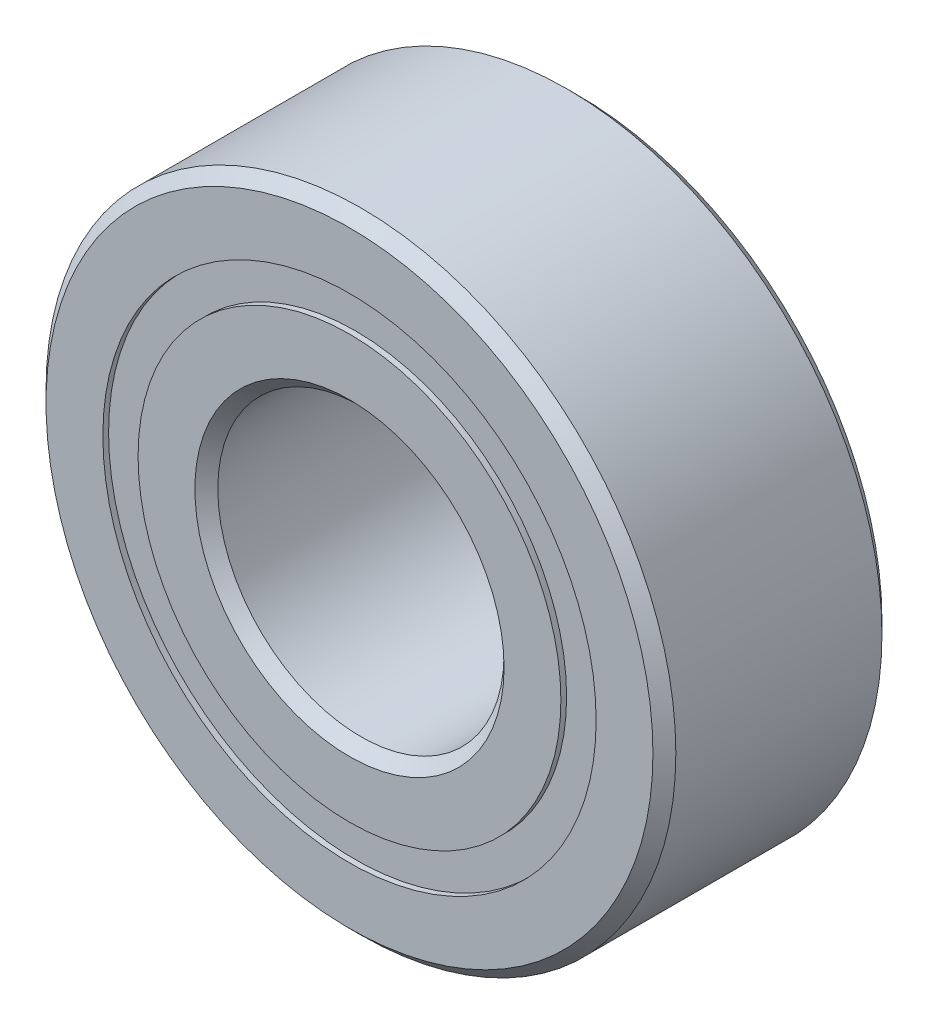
ISO-10303-21;
HEADER;
FILE_DESCRIPTION(('STEP AP214'),'2;1');
FILE_NAME('part.step','',(''),(''),'','','');
FILE_SCHEMA(('AUTOMOTIVE_DESIGN { 1 0 10303 214 1 1 1 1 }'));
ENDSEC;
DATA;
#1=APPLICATION_CONTEXT('core data for automotive mechanical design processes');
#2=APPLICATION_PROTOCOL_DEFINITION('international standard','automotive_design',2000,#1);
#3=PRODUCT_CONTEXT('',#1,'mechanical');
#4=PRODUCT('Part','Part','',(#3));
#5=PRODUCT_RELATED_PRODUCT_CATEGORY('part','',(#4));
#6=PRODUCT_DEFINITION_FORMATION('','',#4);
#7=PRODUCT_DEFINITION_CONTEXT('part definition',#1,'design');
#8=PRODUCT_DEFINITION('design','',#6,#7);
#9=PRODUCT_DEFINITION_SHAPE('','',#8);
#10=(LENGTH_UNIT() NAMED_UNIT(*) SI_UNIT(.MILLI.,.METRE.));
#11=(NAMED_UNIT(*) PLANE_ANGLE_UNIT() SI_UNIT($,.RADIAN.));
#12=(NAMED_UNIT(*) SI_UNIT($,.STERADIAN.) SOLID_ANGLE_UNIT());
#13=UNCERTAINTY_MEASURE_WITH_UNIT(LENGTH_MEASURE(1.E-05),#10,'distance_accuracy_value','');
#14=(GEOMETRIC_REPRESENTATION_CONTEXT(3) GLOBAL_UNCERTAINTY_ASSIGNED_CONTEXT((#13)) GLOBAL_UNIT_ASSIGNED_CONTEXT((#10,
#11,#12)) REPRESENTATION_CONTEXT('',''));
#15=CARTESIAN_POINT('',(0.,0.,0.));
#16=DIRECTION('',(0.,0.,1.));
#17=DIRECTION('',(1.,0.,0.));
#18=AXIS2_PLACEMENT_3D('',#15,#16,#17);
#19=CARTESIAN_POINT('',(0.,4.30769230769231,-1.9));
#20=DIRECTION('',(0.,0.,1.));
#21=DIRECTION('',(1.,0.,0.));
#22=AXIS2_PLACEMENT_3D('',#19,#20,#21);
#23=PLANE('',#22);
#24=CARTESIAN_POINT('',(0.,0.,-1.9));
#25=DIRECTION('',(0.,0.,1.));
#26=DIRECTION('',(1.,0.,0.));
#27=AXIS2_PLACEMENT_3D('',#24,#25,#26);
#28=CIRCLE('',#27,4.30769230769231);
#29=CARTESIAN_POINT('',(4.30769230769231,0.,-1.9));
#30=VERTEX_POINT('',#29);
#31=EDGE_CURVE('E55',#30,#30,#28,.T.);
#32=ORIENTED_EDGE('',*,*,#31,.F.);
#33=EDGE_LOOP('',(#32));
#34=FACE_BOUND('',#33,.T.);
#35=CARTESIAN_POINT('',(0.,0.,-1.9));
#36=DIRECTION('',(0.,0.,1.));
#37=DIRECTION('',(1.,0.,0.));
#38=AXIS2_PLACEMENT_3D('',#35,#36,#37);
#39=CIRCLE('',#38,3.69230769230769);
#40=CARTESIAN_POINT('',(3.69230769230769,0.,-1.9));
#41=VERTEX_POINT('',#40);
#42=EDGE_CURVE('E11',#41,#41,#39,.T.);
#43=ORIENTED_EDGE('',*,*,#42,.T.);
#44=EDGE_LOOP('',(#43));
#45=FACE_BOUND('',#44,.T.);
#46=ADVANCED_FACE('F41',(#34,#45),#23,.F.);
#47=CARTESIAN_POINT('',(0.,0.,2.));
#48=DIRECTION('',(0.,0.,1.));
#49=DIRECTION('',(1.,0.,0.));
#50=AXIS2_PLACEMENT_3D('',#47,#48,#49);
#51=CYLINDRICAL_SURFACE('',#50,3.69230769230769);
#52=ORIENTED_EDGE('',*,*,#42,.F.);
#53=EDGE_LOOP('',(#52));
#54=FACE_BOUND('',#53,.T.);
#55=CARTESIAN_POINT('',(0.,0.,-0.940637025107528));
#56=DIRECTION('',(0.,0.,1.));
#57=DIRECTION('',(1.,0.,0.));
#58=AXIS2_PLACEMENT_3D('',#55,#56,#57);
#59=CIRCLE('',#58,3.69230769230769);
#60=CARTESIAN_POINT('',(3.69230769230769,0.,-0.940637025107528));
#61=VERTEX_POINT('',#60);
#62=EDGE_CURVE('E47',#61,#61,#59,.T.);
#63=ORIENTED_EDGE('',*,*,#62,.T.);
#64=EDGE_LOOP('',(#63));
#65=FACE_BOUND('',#64,.T.);
#66=ADVANCED_FACE('F64',(#54,#65),#51,.F.);
#67=CARTESIAN_POINT('',(0.,4.30769230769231,-0.940637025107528));
#68=DIRECTION('',(0.,0.,-1.));
#69=DIRECTION('',(-1.,0.,0.));
#70=AXIS2_PLACEMENT_3D('',#67,#68,#69);
#71=PLANE('',#70);
#72=ORIENTED_EDGE('',*,*,#62,.F.);
#73=EDGE_LOOP('',(#72));
#74=FACE_BOUND('',#73,.T.);
#75=CARTESIAN_POINT('',(0.,0.,-0.940637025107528));
#76=DIRECTION('',(0.,0.,1.));
#77=DIRECTION('',(1.,0.,0.));
#78=AXIS2_PLACEMENT_3D('',#75,#76,#77);
#79=CIRCLE('',#78,4.30769230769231);
#80=CARTESIAN_POINT('',(4.30769230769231,0.,-0.940637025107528));
#81=VERTEX_POINT('',#80);
#82=EDGE_CURVE('E51',#81,#81,#79,.T.);
#83=ORIENTED_EDGE('',*,*,#82,.T.);
#84=EDGE_LOOP('',(#83));
#85=FACE_BOUND('',#84,.T.);
#86=ADVANCED_FACE('F68',(#74,#85),#71,.F.);
#87=CARTESIAN_POINT('',(0.,0.,2.));
#88=DIRECTION('',(0.,0.,1.));
#89=DIRECTION('',(1.,0.,0.));
#90=AXIS2_PLACEMENT_3D('',#87,#88,#89);
#91=CYLINDRICAL_SURFACE('',#90,4.30769230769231);
#92=ORIENTED_EDGE('',*,*,#82,.F.);
#93=EDGE_LOOP('',(#92));
#94=FACE_BOUND('',#93,.T.);
#95=ORIENTED_EDGE('',*,*,#31,.T.);
#96=EDGE_LOOP('',(#95));
#97=FACE_BOUND('',#96,.T.);
#98=ADVANCED_FACE('F61',(#94,#97),#91,.T.);
#99=CLOSED_SHELL('',(#46,#66,#86,#98));
#100=MANIFOLD_SOLID_BREP('B2',#99);
#101=CARTESIAN_POINT('',(0.,4.30769230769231,1.9));
#102=DIRECTION('',(0.,0.,-1.));
#103=DIRECTION('',(-1.,0.,0.));
#104=AXIS2_PLACEMENT_3D('',#101,#102,#103);
#105=PLANE('',#104);
#106=CARTESIAN_POINT('',(0.,0.,1.9));
#107=DIRECTION('',(0.,0.,1.));
#108=DIRECTION('',(1.,0.,0.));
#109=AXIS2_PLACEMENT_3D('',#106,#107,#108);
#110=CIRCLE('',#109,3.69230769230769);
#111=CARTESIAN_POINT('',(3.69230769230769,0.,1.9));
#112=VERTEX_POINT('',#111);
#113=EDGE_CURVE('E40',#112,#112,#110,.T.);
#114=ORIENTED_EDGE('',*,*,#113,.F.);
#115=EDGE_LOOP('',(#114));
#116=FACE_BOUND('',#115,.T.);
#117=CARTESIAN_POINT('',(0.,0.,1.9));
#118=DIRECTION('',(0.,0.,1.));
#119=DIRECTION('',(1.,0.,0.));
#120=AXIS2_PLACEMENT_3D('',#117,#118,#119);
#121=CIRCLE('',#120,4.30769230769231);
#122=CARTESIAN_POINT('',(4.30769230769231,0.,1.9));
#123=VERTEX_POINT('',#122);
#124=EDGE_CURVE('E122',#123,#123,#121,.T.);
#125=ORIENTED_EDGE('',*,*,#124,.T.);
#126=EDGE_LOOP('',(#125));
#127=FACE_BOUND('',#126,.T.);
#128=ADVANCED_FACE('F108',(#116,#127),#105,.F.);
#129=CARTESIAN_POINT('',(0.,0.,2.));
#130=DIRECTION('',(0.,0.,1.));
#131=DIRECTION('',(1.,0.,0.));
#132=AXIS2_PLACEMENT_3D('',#129,#130,#131);
#133=CYLINDRICAL_SURFACE('',#132,3.69230769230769);
#134=CARTESIAN_POINT('',(0.,0.,0.940637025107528));
#135=DIRECTION('',(0.,0.,1.));
#136=DIRECTION('',(1.,0.,0.));
#137=AXIS2_PLACEMENT_3D('',#134,#135,#136);
#138=CIRCLE('',#137,3.69230769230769);
#139=CARTESIAN_POINT('',(3.69230769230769,0.,0.940637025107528));
#140=VERTEX_POINT('',#139);
#141=EDGE_CURVE('E114',#140,#140,#138,.T.);
#142=ORIENTED_EDGE('',*,*,#141,.F.);
#143=EDGE_LOOP('',(#142));
#144=FACE_BOUND('',#143,.T.);
#145=ORIENTED_EDGE('',*,*,#113,.T.);
#146=EDGE_LOOP('',(#145));
#147=FACE_BOUND('',#146,.T.);
#148=ADVANCED_FACE('F137',(#144,#147),#133,.F.);
#149=CARTESIAN_POINT('',(0.,4.30769230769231,0.940637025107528));
#150=DIRECTION('',(0.,0.,1.));
#151=DIRECTION('',(1.,0.,0.));
#152=AXIS2_PLACEMENT_3D('',#149,#150,#151);
#153=PLANE('',#152);
#154=CARTESIAN_POINT('',(0.,0.,0.940637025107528));
#155=DIRECTION('',(0.,0.,1.));
#156=DIRECTION('',(1.,0.,0.));
#157=AXIS2_PLACEMENT_3D('',#154,#155,#156);
#158=CIRCLE('',#157,4.30769230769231);
#159=CARTESIAN_POINT('',(4.30769230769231,0.,0.940637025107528));
#160=VERTEX_POINT('',#159);
#161=EDGE_CURVE('E118',#160,#160,#158,.T.);
#162=ORIENTED_EDGE('',*,*,#161,.F.);
#163=EDGE_LOOP('',(#162));
#164=FACE_BOUND('',#163,.T.);
#165=ORIENTED_EDGE('',*,*,#141,.T.);
#166=EDGE_LOOP('',(#165));
#167=FACE_BOUND('',#166,.T.);
#168=ADVANCED_FACE('F132',(#164,#167),#153,.F.);
#169=CARTESIAN_POINT('',(0.,0.,2.));
#170=DIRECTION('',(0.,0.,1.));
#171=DIRECTION('',(1.,0.,0.));
#172=AXIS2_PLACEMENT_3D('',#169,#170,#171);
#173=CYLINDRICAL_SURFACE('',#172,4.30769230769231);
#174=ORIENTED_EDGE('',*,*,#124,.F.);
#175=EDGE_LOOP('',(#174));
#176=FACE_BOUND('',#175,.T.);
#177=ORIENTED_EDGE('',*,*,#161,.T.);
#178=EDGE_LOOP('',(#177));
#179=FACE_BOUND('',#178,.T.);
#180=ADVANCED_FACE('F129',(#176,#179),#173,.T.);
#181=CLOSED_SHELL('',(#128,#148,#168,#180));
#182=MANIFOLD_SOLID_BREP('B6',#181);
#183=CARTESIAN_POINT('',(-1.99999999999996,3.46410161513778,0.));
#184=DIRECTION('',(0.,0.,1.));
#185=DIRECTION('',(-0.499999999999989,0.866025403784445,0.));
#186=AXIS2_PLACEMENT_3D('',#183,#184,#185);
#187=SPHERICAL_SURFACE('',#186,0.940637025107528);
#188=CARTESIAN_POINT('',(-1.99999999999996,3.46410161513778,0.940637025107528));
#189=VERTEX_POINT('',#188);
#190=VERTEX_LOOP('',#189);
#191=FACE_BOUND('',#190,.T.);
#192=ADVANCED_FACE('F175',(#191),#187,.T.);
#193=CLOSED_SHELL('',(#192));
#194=MANIFOLD_SOLID_BREP('B35',#193);
#195=CARTESIAN_POINT('',(-3.46410161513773,2.00000000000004,0.));
#196=DIRECTION('',(0.,0.,1.));
#197=DIRECTION('',(-0.866025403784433,0.50000000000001,0.));
#198=AXIS2_PLACEMENT_3D('',#195,#196,#197);
#199=SPHERICAL_SURFACE('',#198,0.940637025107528);
#200=CARTESIAN_POINT('',(-3.46410161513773,2.00000000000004,0.940637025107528));
#201=VERTEX_POINT('',#200);
#202=VERTEX_LOOP('',#201);
#203=FACE_BOUND('',#202,.T.);
#204=ADVANCED_FACE('F195',(#203),#199,.T.);
#205=CLOSED_SHELL('',(#204));
#206=MANIFOLD_SOLID_BREP('B104',#205);
#207=CARTESIAN_POINT('',(-4.,0.,0.));
#208=DIRECTION('',(0.,0.,1.));
#209=DIRECTION('',(-1.,0.,0.));
#210=AXIS2_PLACEMENT_3D('',#207,#208,#209);
#211=SPHERICAL_SURFACE('',#210,0.940637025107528);
#212=CARTESIAN_POINT('',(-4.,0.,0.940637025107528));
#213=VERTEX_POINT('',#212);
#214=VERTEX_LOOP('',#213);
#215=FACE_BOUND('',#214,.T.);
#216=ADVANCED_FACE('F215',(#215),#211,.T.);
#217=CLOSED_SHELL('',(#216));
#218=MANIFOLD_SOLID_BREP('B171',#217);
#219=CARTESIAN_POINT('',(-3.46410161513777,-1.99999999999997,0.));
#220=DIRECTION('',(0.,0.,1.));
#221=DIRECTION('',(-0.866025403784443,-0.499999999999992,0.));
#222=AXIS2_PLACEMENT_3D('',#219,#220,#221);
#223=SPHERICAL_SURFACE('',#222,0.940637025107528);
#224=CARTESIAN_POINT('',(-3.46410161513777,-1.99999999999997,0.940637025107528));
#225=VERTEX_POINT('',#224);
#226=VERTEX_LOOP('',#225);
#227=FACE_BOUND('',#226,.T.);
#228=ADVANCED_FACE('F235',(#227),#223,.T.);
#229=CLOSED_SHELL('',(#228));
#230=MANIFOLD_SOLID_BREP('B191',#229);
#231=CARTESIAN_POINT('',(-2.00000000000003,-3.46410161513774,0.));
#232=DIRECTION('',(0.,0.,1.));
#233=DIRECTION('',(-0.500000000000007,-0.866025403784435,0.));
#234=AXIS2_PLACEMENT_3D('',#231,#232,#233);
#235=SPHERICAL_SURFACE('',#234,0.940637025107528);
#236=CARTESIAN_POINT('',(-2.00000000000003,-3.46410161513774,0.940637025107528));
#237=VERTEX_POINT('',#236);
#238=VERTEX_LOOP('',#237);
#239=FACE_BOUND('',#238,.T.);
#240=ADVANCED_FACE('F255',(#239),#235,.T.);
#241=CLOSED_SHELL('',(#240));
#242=MANIFOLD_SOLID_BREP('B211',#241);
#243=CARTESIAN_POINT('',(0.,-4.,0.));
#244=DIRECTION('',(0.,0.,1.));
#245=DIRECTION('',(0.,-1.,0.));
#246=AXIS2_PLACEMENT_3D('',#243,#244,#245);
#247=SPHERICAL_SURFACE('',#246,0.940637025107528);
#248=CARTESIAN_POINT('',(0.,-4.,0.940637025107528));
#249=VERTEX_POINT('',#248);
#250=VERTEX_LOOP('',#249);
#251=FACE_BOUND('',#250,.T.);
#252=ADVANCED_FACE('F275',(#251),#247,.T.);
#253=CLOSED_SHELL('',(#252));
#254=MANIFOLD_SOLID_BREP('B231',#253);
#255=CARTESIAN_POINT('',(1.99999999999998,-3.46410161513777,0.));
#256=DIRECTION('',(0.,0.,1.));
#257=DIRECTION('',(0.499999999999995,-0.866025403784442,0.));
#258=AXIS2_PLACEMENT_3D('',#255,#256,#257);
#259=SPHERICAL_SURFACE('',#258,0.940637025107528);
#260=CARTESIAN_POINT('',(1.99999999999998,-3.46410161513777,0.940637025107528));
#261=VERTEX_POINT('',#260);
#262=VERTEX_LOOP('',#261);
#263=FACE_BOUND('',#262,.T.);
#264=ADVANCED_FACE('F295',(#263),#259,.T.);
#265=CLOSED_SHELL('',(#264));
#266=MANIFOLD_SOLID_BREP('B251',#265);
#267=CARTESIAN_POINT('',(3.46410161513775,-2.00000000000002,0.));
#268=DIRECTION('',(0.,0.,1.));
#269=DIRECTION('',(0.866025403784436,-0.500000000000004,0.));
#270=AXIS2_PLACEMENT_3D('',#267,#268,#269);
#271=SPHERICAL_SURFACE('',#270,0.940637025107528);
#272=CARTESIAN_POINT('',(3.46410161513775,-2.00000000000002,0.940637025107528));
#273=VERTEX_POINT('',#272);
#274=VERTEX_LOOP('',#273);
#275=FACE_BOUND('',#274,.T.);
#276=ADVANCED_FACE('F315',(#275),#271,.T.);
#277=CLOSED_SHELL('',(#276));
#278=MANIFOLD_SOLID_BREP('B271',#277);
#279=CARTESIAN_POINT('',(4.,0.,0.));
#280=DIRECTION('',(0.,0.,1.));
#281=DIRECTION('',(1.,0.,0.));
#282=AXIS2_PLACEMENT_3D('',#279,#280,#281);
#283=SPHERICAL_SURFACE('',#282,0.940637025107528);
#284=CARTESIAN_POINT('',(4.,0.,0.940637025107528));
#285=VERTEX_POINT('',#284);
#286=VERTEX_LOOP('',#285);
#287=FACE_BOUND('',#286,.T.);
#288=ADVANCED_FACE('F335',(#287),#283,.T.);
#289=CLOSED_SHELL('',(#288));
#290=MANIFOLD_SOLID_BREP('B291',#289);
#291=CARTESIAN_POINT('',(3.46410161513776,1.99999999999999,0.));
#292=DIRECTION('',(0.,0.,1.));
#293=DIRECTION('',(0.86602540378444,0.499999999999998,0.));
#294=AXIS2_PLACEMENT_3D('',#291,#292,#293);
#295=SPHERICAL_SURFACE('',#294,0.940637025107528);
#296=CARTESIAN_POINT('',(3.46410161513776,1.99999999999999,0.940637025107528));
#297=VERTEX_POINT('',#296);
#298=VERTEX_LOOP('',#297);
#299=FACE_BOUND('',#298,.T.);
#300=ADVANCED_FACE('F355',(#299),#295,.T.);
#301=CLOSED_SHELL('',(#300));
#302=MANIFOLD_SOLID_BREP('B311',#301);
#303=CARTESIAN_POINT('',(2.,3.46410161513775,0.));
#304=DIRECTION('',(0.,0.,1.));
#305=DIRECTION('',(0.500000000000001,0.866025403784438,0.));
#306=AXIS2_PLACEMENT_3D('',#303,#304,#305);
#307=SPHERICAL_SURFACE('',#306,0.940637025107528);
#308=CARTESIAN_POINT('',(2.,3.46410161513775,0.940637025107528));
#309=VERTEX_POINT('',#308);
#310=VERTEX_LOOP('',#309);
#311=FACE_BOUND('',#310,.T.);
#312=ADVANCED_FACE('F375',(#311),#307,.T.);
#313=CLOSED_SHELL('',(#312));
#314=MANIFOLD_SOLID_BREP('B331',#313);
#315=CARTESIAN_POINT('',(0.,4.,0.));
#316=DIRECTION('',(0.,0.,1.));
#317=DIRECTION('',(0.,1.,0.));
#318=AXIS2_PLACEMENT_3D('',#315,#316,#317);
#319=SPHERICAL_SURFACE('',#318,0.940637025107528);
#320=CARTESIAN_POINT('',(0.,4.,0.940637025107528));
#321=VERTEX_POINT('',#320);
#322=VERTEX_LOOP('',#321);
#323=FACE_BOUND('',#322,.T.);
#324=ADVANCED_FACE('F397',(#323),#319,.T.);
#325=CLOSED_SHELL('',(#324));
#326=MANIFOLD_SOLID_BREP('B351',#325);
#327=CARTESIAN_POINT('',(0.,3.69230769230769,2.));
#328=DIRECTION('',(0.,0.,-1.));
#329=DIRECTION('',(-1.,0.,0.));
#330=AXIS2_PLACEMENT_3D('',#327,#328,#329);
#331=PLANE('',#330);
#332=CARTESIAN_POINT('',(0.,0.,2.));
#333=DIRECTION('',(0.,0.,1.));
#334=DIRECTION('',(1.,0.,0.));
#335=AXIS2_PLACEMENT_3D('',#332,#333,#334);
#336=CIRCLE('',#335,2.7);
#337=CARTESIAN_POINT('',(2.7,0.,2.));
#338=VERTEX_POINT('',#337);
#339=EDGE_CURVE('E444',#338,#338,#336,.T.);
#340=ORIENTED_EDGE('',*,*,#339,.F.);
#341=EDGE_LOOP('',(#340));
#342=FACE_BOUND('',#341,.T.);
#343=CARTESIAN_POINT('',(0.,0.,2.));
#344=DIRECTION('',(0.,0.,1.));
#345=DIRECTION('',(1.,0.,0.));
#346=AXIS2_PLACEMENT_3D('',#343,#344,#345);
#347=CIRCLE('',#346,3.69230769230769);
#348=CARTESIAN_POINT('',(3.69230769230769,0.,2.));
#349=VERTEX_POINT('',#348);
#350=EDGE_CURVE('E396',#349,#349,#347,.T.);
#351=ORIENTED_EDGE('',*,*,#350,.T.);
#352=EDGE_LOOP('',(#351));
#353=FACE_BOUND('',#352,.T.);
#354=ADVANCED_FACE('F416',(#342,#353),#331,.F.);
#355=CARTESIAN_POINT('',(0.,0.,2.));
#356=DIRECTION('',(0.,0.,1.));
#357=DIRECTION('',(1.,0.,0.));
#358=AXIS2_PLACEMENT_3D('',#355,#356,#357);
#359=CYLINDRICAL_SURFACE('',#358,3.69230769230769);
#360=ORIENTED_EDGE('',*,*,#350,.F.);
#361=EDGE_LOOP('',(#360));
#362=FACE_BOUND('',#361,.T.);
#363=CARTESIAN_POINT('',(0.,0.,0.888888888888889));
#364=DIRECTION('',(0.,0.,1.));
#365=DIRECTION('',(1.,0.,0.));
#366=AXIS2_PLACEMENT_3D('',#363,#364,#365);
#367=CIRCLE('',#366,3.69230769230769);
#368=CARTESIAN_POINT('',(3.69230769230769,0.,0.888888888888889));
#369=VERTEX_POINT('',#368);
#370=EDGE_CURVE('E422',#369,#369,#367,.T.);
#371=ORIENTED_EDGE('',*,*,#370,.T.);
#372=EDGE_LOOP('',(#371));
#373=FACE_BOUND('',#372,.T.);
#374=ADVANCED_FACE('F451',(#362,#373),#359,.T.);
#375=CARTESIAN_POINT('',(0.,0.,0.));
#376=DIRECTION('',(0.,0.,1.));
#377=DIRECTION('',(1.,0.,0.));
#378=AXIS2_PLACEMENT_3D('',#375,#376,#377);
#379=TOROIDAL_SURFACE('',#378,3.99999999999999,0.940637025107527);
#380=ORIENTED_EDGE('',*,*,#370,.F.);
#381=EDGE_LOOP('',(#380));
#382=FACE_BOUND('',#381,.T.);
#383=CARTESIAN_POINT('',(0.,0.,-0.88888888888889));
#384=DIRECTION('',(0.,0.,1.));
#385=DIRECTION('',(1.,0.,0.));
#386=AXIS2_PLACEMENT_3D('',#383,#384,#385);
#387=CIRCLE('',#386,3.69230769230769);
#388=CARTESIAN_POINT('',(3.69230769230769,0.,-0.88888888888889));
#389=VERTEX_POINT('',#388);
#390=EDGE_CURVE('E426',#389,#389,#387,.T.);
#391=ORIENTED_EDGE('',*,*,#390,.T.);
#392=EDGE_LOOP('',(#391));
#393=FACE_BOUND('',#392,.T.);
#394=ADVANCED_FACE('F455',(#382,#393),#379,.F.);
#395=CARTESIAN_POINT('',(0.,0.,2.));
#396=DIRECTION('',(0.,0.,1.));
#397=DIRECTION('',(1.,0.,0.));
#398=AXIS2_PLACEMENT_3D('',#395,#396,#397);
#399=CYLINDRICAL_SURFACE('',#398,3.69230769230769);
#400=ORIENTED_EDGE('',*,*,#390,.F.);
#401=EDGE_LOOP('',(#400));
#402=FACE_BOUND('',#401,.T.);
#403=CARTESIAN_POINT('',(0.,0.,-2.));
#404=DIRECTION('',(0.,0.,1.));
#405=DIRECTION('',(1.,0.,0.));
#406=AXIS2_PLACEMENT_3D('',#403,#404,#405);
#407=CIRCLE('',#406,3.69230769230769);
#408=CARTESIAN_POINT('',(3.69230769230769,0.,-2.));
#409=VERTEX_POINT('',#408);
#410=EDGE_CURVE('E430',#409,#409,#407,.T.);
#411=ORIENTED_EDGE('',*,*,#410,.T.);
#412=EDGE_LOOP('',(#411));
#413=FACE_BOUND('',#412,.T.);
#414=ADVANCED_FACE('F460',(#402,#413),#399,.T.);
#415=CARTESIAN_POINT('',(0.,2.7,-2.));
#416=DIRECTION('',(0.,0.,1.));
#417=DIRECTION('',(1.,0.,0.));
#418=AXIS2_PLACEMENT_3D('',#415,#416,#417);
#419=PLANE('',#418);
#420=ORIENTED_EDGE('',*,*,#410,.F.);
#421=EDGE_LOOP('',(#420));
#422=FACE_BOUND('',#421,.T.);
#423=CARTESIAN_POINT('',(0.,0.,-2.));
#424=DIRECTION('',(0.,0.,1.));
#425=DIRECTION('',(1.,0.,0.));
#426=AXIS2_PLACEMENT_3D('',#423,#424,#425);
#427=CIRCLE('',#426,2.7);
#428=CARTESIAN_POINT('',(2.7,0.,-2.));
#429=VERTEX_POINT('',#428);
#430=EDGE_CURVE('E435',#429,#429,#427,.T.);
#431=ORIENTED_EDGE('',*,*,#430,.T.);
#432=EDGE_LOOP('',(#431));
#433=FACE_BOUND('',#432,.T.);
#434=ADVANCED_FACE('F466',(#422,#433),#419,.F.);
#435=CARTESIAN_POINT('',(0.,0.,-1.8));
#436=DIRECTION('',(0.,0.,-1.));
#437=DIRECTION('',(-1.,0.,0.));
#438=AXIS2_PLACEMENT_3D('',#435,#436,#437);
#439=CONICAL_SURFACE('',#438,2.5,0.785398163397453);
#440=ORIENTED_EDGE('',*,*,#430,.F.);
#441=EDGE_LOOP('',(#440));
#442=FACE_BOUND('',#441,.T.);
#443=CARTESIAN_POINT('',(0.,0.,-1.8));
#444=DIRECTION('',(0.,0.,1.));
#445=DIRECTION('',(1.,0.,0.));
#446=AXIS2_PLACEMENT_3D('',#443,#444,#445);
#447=CIRCLE('',#446,2.5);
#448=CARTESIAN_POINT('',(2.5,0.,-1.8));
#449=VERTEX_POINT('',#448);
#450=EDGE_CURVE('E438',#449,#449,#447,.T.);
#451=ORIENTED_EDGE('',*,*,#450,.T.);
#452=EDGE_LOOP('',(#451));
#453=FACE_BOUND('',#452,.T.);
#454=ADVANCED_FACE('F470',(#442,#453),#439,.F.);
#455=CARTESIAN_POINT('',(0.,0.,2.));
#456=DIRECTION('',(0.,0.,1.));
#457=DIRECTION('',(1.,0.,0.));
#458=AXIS2_PLACEMENT_3D('',#455,#456,#457);
#459=CYLINDRICAL_SURFACE('',#458,2.5);
#460=ORIENTED_EDGE('',*,*,#450,.F.);
#461=EDGE_LOOP('',(#460));
#462=FACE_BOUND('',#461,.T.);
#463=CARTESIAN_POINT('',(0.,0.,1.8));
#464=DIRECTION('',(0.,0.,1.));
#465=DIRECTION('',(1.,0.,0.));
#466=AXIS2_PLACEMENT_3D('',#463,#464,#465);
#467=CIRCLE('',#466,2.5);
#468=CARTESIAN_POINT('',(2.5,0.,1.8));
#469=VERTEX_POINT('',#468);
#470=EDGE_CURVE('E441',#469,#469,#467,.T.);
#471=ORIENTED_EDGE('',*,*,#470,.T.);
#472=EDGE_LOOP('',(#471));
#473=FACE_BOUND('',#472,.T.);
#474=ADVANCED_FACE('F474',(#462,#473),#459,.F.);
#475=CARTESIAN_POINT('',(0.,0.,2.));
#476=DIRECTION('',(0.,0.,1.));
#477=DIRECTION('',(1.,0.,0.));
#478=AXIS2_PLACEMENT_3D('',#475,#476,#477);
#479=CONICAL_SURFACE('',#478,2.7,0.785398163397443);
#480=ORIENTED_EDGE('',*,*,#470,.F.);
#481=EDGE_LOOP('',(#480));
#482=FACE_BOUND('',#481,.T.);
#483=ORIENTED_EDGE('',*,*,#339,.T.);
#484=EDGE_LOOP('',(#483));
#485=FACE_BOUND('',#484,.T.);
#486=ADVANCED_FACE('F448',(#482,#485),#479,.F.);
#487=CLOSED_SHELL('',(#354,#374,#394,#414,#434,#454,#474,#486));
#488=MANIFOLD_SOLID_BREP('B371',#487);
#489=CARTESIAN_POINT('',(0.,0.,1.8));
#490=DIRECTION('',(0.,0.,-1.));
#491=DIRECTION('',(-1.,0.,0.));
#492=AXIS2_PLACEMENT_3D('',#489,#490,#491);
#493=CONICAL_SURFACE('',#492,5.5,0.785398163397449);
#494=CARTESIAN_POINT('',(0.,0.,2.));
#495=DIRECTION('',(0.,0.,1.));
#496=DIRECTION('',(1.,0.,0.));
#497=AXIS2_PLACEMENT_3D('',#494,#495,#496);
#498=CIRCLE('',#497,5.3);
#499=CARTESIAN_POINT('',(5.3,0.,2.));
#500=VERTEX_POINT('',#499);
#501=EDGE_CURVE('E565',#500,#500,#498,.T.);
#502=ORIENTED_EDGE('',*,*,#501,.F.);
#503=EDGE_LOOP('',(#502));
#504=FACE_BOUND('',#503,.T.);
#505=CARTESIAN_POINT('',(0.,0.,1.8));
#506=DIRECTION('',(0.,0.,1.));
#507=DIRECTION('',(1.,0.,0.));
#508=AXIS2_PLACEMENT_3D('',#505,#506,#507);
#509=CIRCLE('',#508,5.5);
#510=CARTESIAN_POINT('',(5.5,0.,1.8));
#511=VERTEX_POINT('',#510);
#512=EDGE_CURVE('E415',#511,#511,#509,.T.);
#513=ORIENTED_EDGE('',*,*,#512,.T.);
#514=EDGE_LOOP('',(#513));
#515=FACE_BOUND('',#514,.T.);
#516=ADVANCED_FACE('F537',(#504,#515),#493,.T.);
#517=CARTESIAN_POINT('',(0.,0.,2.));
#518=DIRECTION('',(0.,0.,1.));
#519=DIRECTION('',(1.,0.,0.));
#520=AXIS2_PLACEMENT_3D('',#517,#518,#519);
#521=CYLINDRICAL_SURFACE('',#520,5.5);
#522=ORIENTED_EDGE('',*,*,#512,.F.);
#523=EDGE_LOOP('',(#522));
#524=FACE_BOUND('',#523,.T.);
#525=CARTESIAN_POINT('',(0.,0.,-1.8));
#526=DIRECTION('',(0.,0.,1.));
#527=DIRECTION('',(1.,0.,0.));
#528=AXIS2_PLACEMENT_3D('',#525,#526,#527);
#529=CIRCLE('',#528,5.5);
#530=CARTESIAN_POINT('',(5.5,0.,-1.8));
#531=VERTEX_POINT('',#530);
#532=EDGE_CURVE('E543',#531,#531,#529,.T.);
#533=ORIENTED_EDGE('',*,*,#532,.T.);
#534=EDGE_LOOP('',(#533));
#535=FACE_BOUND('',#534,.T.);
#536=ADVANCED_FACE('F572',(#524,#535),#521,.T.);
#537=CARTESIAN_POINT('',(0.,0.,-2.));
#538=DIRECTION('',(0.,0.,1.));
#539=DIRECTION('',(1.,0.,0.));
#540=AXIS2_PLACEMENT_3D('',#537,#538,#539);
#541=CONICAL_SURFACE('',#540,5.3,0.78539816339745);
#542=ORIENTED_EDGE('',*,*,#532,.F.);
#543=EDGE_LOOP('',(#542));
#544=FACE_BOUND('',#543,.T.);
#545=CARTESIAN_POINT('',(0.,0.,-2.));
#546=DIRECTION('',(0.,0.,1.));
#547=DIRECTION('',(1.,0.,0.));
#548=AXIS2_PLACEMENT_3D('',#545,#546,#547);
#549=CIRCLE('',#548,5.3);
#550=CARTESIAN_POINT('',(5.3,0.,-2.));
#551=VERTEX_POINT('',#550);
#552=EDGE_CURVE('E547',#551,#551,#549,.T.);
#553=ORIENTED_EDGE('',*,*,#552,.T.);
#554=EDGE_LOOP('',(#553));
#555=FACE_BOUND('',#554,.T.);
#556=ADVANCED_FACE('F576',(#544,#555),#541,.T.);
#557=CARTESIAN_POINT('',(0.,5.3,-2.));
#558=DIRECTION('',(0.,0.,1.));
#559=DIRECTION('',(1.,0.,0.));
#560=AXIS2_PLACEMENT_3D('',#557,#558,#559);
#561=PLANE('',#560);
#562=ORIENTED_EDGE('',*,*,#552,.F.);
#563=EDGE_LOOP('',(#562));
#564=FACE_BOUND('',#563,.T.);
#565=CARTESIAN_POINT('',(0.,0.,-2.));
#566=DIRECTION('',(0.,0.,1.));
#567=DIRECTION('',(1.,0.,0.));
#568=AXIS2_PLACEMENT_3D('',#565,#566,#567);
#569=CIRCLE('',#568,4.30769230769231);
#570=CARTESIAN_POINT('',(4.30769230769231,0.,-2.));
#571=VERTEX_POINT('',#570);
#572=EDGE_CURVE('E551',#571,#571,#569,.T.);
#573=ORIENTED_EDGE('',*,*,#572,.T.);
#574=EDGE_LOOP('',(#573));
#575=FACE_BOUND('',#574,.T.);
#576=ADVANCED_FACE('F581',(#564,#575),#561,.F.);
#577=CARTESIAN_POINT('',(0.,0.,2.));
#578=DIRECTION('',(0.,0.,1.));
#579=DIRECTION('',(1.,0.,0.));
#580=AXIS2_PLACEMENT_3D('',#577,#578,#579);
#581=CYLINDRICAL_SURFACE('',#580,4.30769230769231);
#582=ORIENTED_EDGE('',*,*,#572,.F.);
#583=EDGE_LOOP('',(#582));
#584=FACE_BOUND('',#583,.T.);
#585=CARTESIAN_POINT('',(0.,0.,-0.888888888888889));
#586=DIRECTION('',(0.,0.,1.));
#587=DIRECTION('',(1.,0.,0.));
#588=AXIS2_PLACEMENT_3D('',#585,#586,#587);
#589=CIRCLE('',#588,4.30769230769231);
#590=CARTESIAN_POINT('',(4.30769230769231,0.,-0.888888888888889));
#591=VERTEX_POINT('',#590);
#592=EDGE_CURVE('E556',#591,#591,#589,.T.);
#593=ORIENTED_EDGE('',*,*,#592,.T.);
#594=EDGE_LOOP('',(#593));
#595=FACE_BOUND('',#594,.T.);
#596=ADVANCED_FACE('F587',(#584,#595),#581,.F.);
#597=CARTESIAN_POINT('',(0.,0.,0.));
#598=DIRECTION('',(0.,0.,1.));
#599=DIRECTION('',(1.,0.,0.));
#600=AXIS2_PLACEMENT_3D('',#597,#598,#599);
#601=TOROIDAL_SURFACE('',#600,4.,0.940637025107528);
#602=ORIENTED_EDGE('',*,*,#592,.F.);
#603=EDGE_LOOP('',(#602));
#604=FACE_BOUND('',#603,.T.);
#605=CARTESIAN_POINT('',(0.,0.,0.888888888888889));
#606=DIRECTION('',(0.,0.,1.));
#607=DIRECTION('',(1.,0.,0.));
#608=AXIS2_PLACEMENT_3D('',#605,#606,#607);
#609=CIRCLE('',#608,4.30769230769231);
#610=CARTESIAN_POINT('',(4.30769230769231,0.,0.888888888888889));
#611=VERTEX_POINT('',#610);
#612=EDGE_CURVE('E559',#611,#611,#609,.T.);
#613=ORIENTED_EDGE('',*,*,#612,.T.);
#614=EDGE_LOOP('',(#613));
#615=FACE_BOUND('',#614,.T.);
#616=ADVANCED_FACE('F591',(#604,#615),#601,.F.);
#617=CARTESIAN_POINT('',(0.,0.,2.));
#618=DIRECTION('',(0.,0.,1.));
#619=DIRECTION('',(1.,0.,0.));
#620=AXIS2_PLACEMENT_3D('',#617,#618,#619);
#621=CYLINDRICAL_SURFACE('',#620,4.30769230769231);
#622=ORIENTED_EDGE('',*,*,#612,.F.);
#623=EDGE_LOOP('',(#622));
#624=FACE_BOUND('',#623,.T.);
#625=CARTESIAN_POINT('',(0.,0.,2.));
#626=DIRECTION('',(0.,0.,1.));
#627=DIRECTION('',(1.,0.,0.));
#628=AXIS2_PLACEMENT_3D('',#625,#626,#627);
#629=CIRCLE('',#628,4.30769230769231);
#630=CARTESIAN_POINT('',(4.30769230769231,0.,2.));
#631=VERTEX_POINT('',#630);
#632=EDGE_CURVE('E562',#631,#631,#629,.T.);
#633=ORIENTED_EDGE('',*,*,#632,.T.);
#634=EDGE_LOOP('',(#633));
#635=FACE_BOUND('',#634,.T.);
#636=ADVANCED_FACE('F595',(#624,#635),#621,.F.);
#637=CARTESIAN_POINT('',(0.,5.3,2.));
#638=DIRECTION('',(0.,0.,-1.));
#639=DIRECTION('',(-1.,0.,0.));
#640=AXIS2_PLACEMENT_3D('',#637,#638,#639);
#641=PLANE('',#640);
#642=ORIENTED_EDGE('',*,*,#632,.F.);
#643=EDGE_LOOP('',(#642));
#644=FACE_BOUND('',#643,.T.);
#645=ORIENTED_EDGE('',*,*,#501,.T.);
#646=EDGE_LOOP('',(#645));
#647=FACE_BOUND('',#646,.T.);
#648=ADVANCED_FACE('F569',(#644,#647),#641,.F.);
#649=CLOSED_SHELL('',(#516,#536,#556,#576,#596,#616,#636,#648));
#650=MANIFOLD_SOLID_BREP('B391',#649);
#651=ADVANCED_BREP_SHAPE_REPRESENTATION('',(#18,#100,#182,#194,#206,#218,#230,#242,#254,#266,
#278,#290,#302,#314,#326,#488,#650),#14);
#652=SHAPE_DEFINITION_REPRESENTATION(#9,#651);
ENDSEC;
END-ISO-10303-21;
